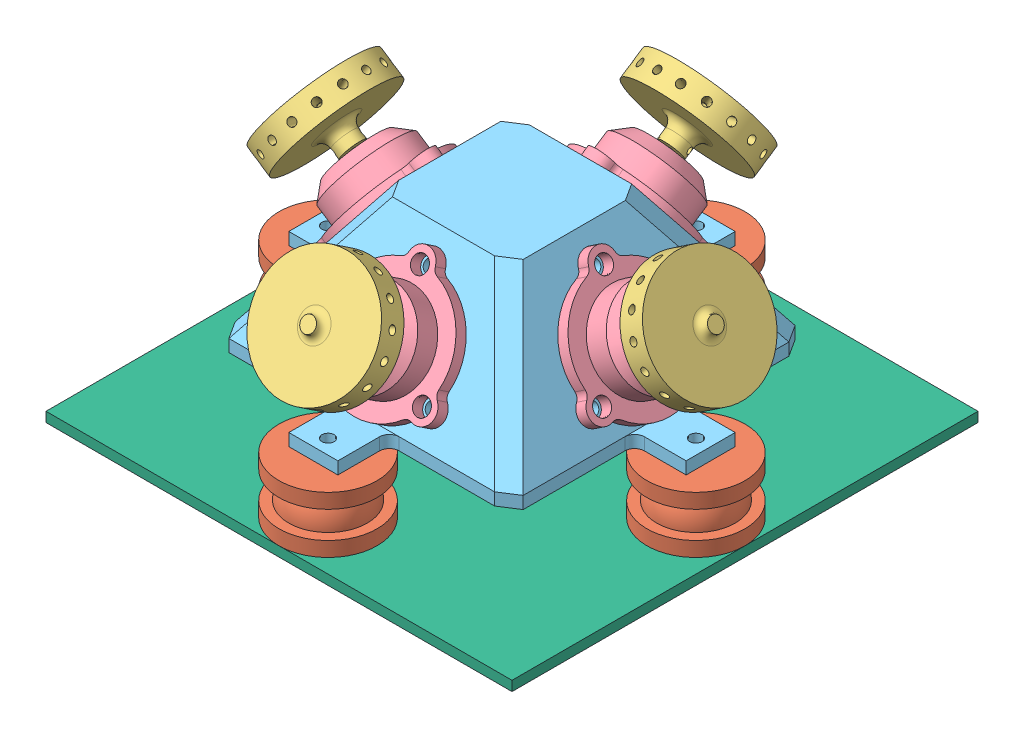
SolidWorks assembly ReactionWheel.SLDASM, configuration Default (file format 7000). Lengths in mm.
Overall size (101.56 52.1 97.82).
18 component instances, 6 part files, 3 mates.
Components (placement in the parent):
- WheelMotor-1: WheelMotor.sldprt [Default] at (0 0 8.3667) x (0.981295 0.160177 -0.106785) z (0.192509 -0.816487 0.544325) size (12 31.15 12)
- WheelMotor-2: WheelMotor.sldprt [Default] at (-8.3667 0 0) x (0.5547 0.83205 0) z (0 0 1) size (12 31.15 12)
- Isolator-1: Isolator.sldprt [Default] at (-37.5 -14 0) size (20 11.5 20)
- Rotor-1: Rotor.sldprt [Default] at (32.4129 16.0308 0) x (-0.282511 0.423767 -0.860586) z (0.477367 -0.716051 -0.509305) size (24 11 24)
- MotorHousing-1: MotorHousing.sldprt [Default] at (0 9.9846 23.3436) x (-0.5 0.720577 -0.480384) z (0.866025 0.416025 -0.27735) size (26.72 9.9 27.25)
- Rotor-2: Rotor.sldprt [Default] at (0 16.0308 -32.4129) x (0.971967 -0.195628 -0.130419) z (0.235115 0.808726 0.539151) size (24 11 24)
- Rotor-3: Rotor.sldprt [Default] at (-32.4129 16.0308 0) x (0.329989 0.494983 -0.803803) z (0.44587 0.668804 0.594896) size (24 11 24)
- MotorHousing-2: MotorHousing.sldprt [Default] at (0 9.9846 -23.3436) x (-1 0 0) z (0 -0.83205 -0.5547) size (26.72 9.9 27.25)
- Rotor-4: Rotor.sldprt [Default] at (0 16.0308 32.4129) x (1 0 0) z (0 -0.83205 0.5547) size (24 11 24)
- MotorHousing-3: MotorHousing.sldprt [Default] at (23.3436 9.9846 0) x (0 0 -1) z (0.5547 -0.83205 0) size (26.72 9.9 27.25)
- WheelMotor-3: WheelMotor.sldprt [Default] at (0 0 -8.3667) x (-0.180972 -0.818312 -0.545541) z (0.983488 -0.150578 -0.100385) size (12 31.15 12)
- Isolator-2: Isolator.sldprt [Default] at (0 -14 -37.5) size (20 11.5 20)
- MotorHousing-4: MotorHousing.sldprt [Default] at (-23.3436 9.9846 0) x (0 0 1) z (-0.5547 -0.83205 0) size (26.72 9.9 27.25)
- Isolator-3: Isolator.sldprt [Default] at (37.5 -14 0) size (20 11.5 20)
- Isolator-4: Isolator.sldprt [Default] at (0 -14 37.5) size (20 11.5 20)
- WheelMotor-4: WheelMotor.sldprt [Default] at (8.3667 0 0) x (0.236092 -0.354138 -0.904901) z (0.501949 -0.752923 0.425621) size (12 31.15 12)
- Housing3U-1: Housing3U.sldprt [Default] at origin size (81 27.5 81)
- RW Baseplate-1: RW Baseplate.SLDPRT [Default] at (0 -16 0) size (95 2 95)
Mates (geometry in assembly coordinates):
- Coincident2: coincident anti-aligned: plane of Isolator-2 through (0 -14 -37.5) normal (0 -1 0); plane of RW Baseplate-1 through (0 -14 0) normal (0 1 0)
- Distance1: distance = 17.5 mm aligned: plane of Housing3U-1 through (-30 -2.5 -27.7129) normal (-1 0 0); plane of RW Baseplate-1 through (-47.5 -14 -47.5) normal (-1 0 0)
- Distance2: distance = 17.5 mm aligned: plane of Housing3U-1 through (27.7129 -2.5 -30) normal (0 0 -1); plane of RW Baseplate-1 through (47.5 -14 -47.5) normal (0 0 -1)
